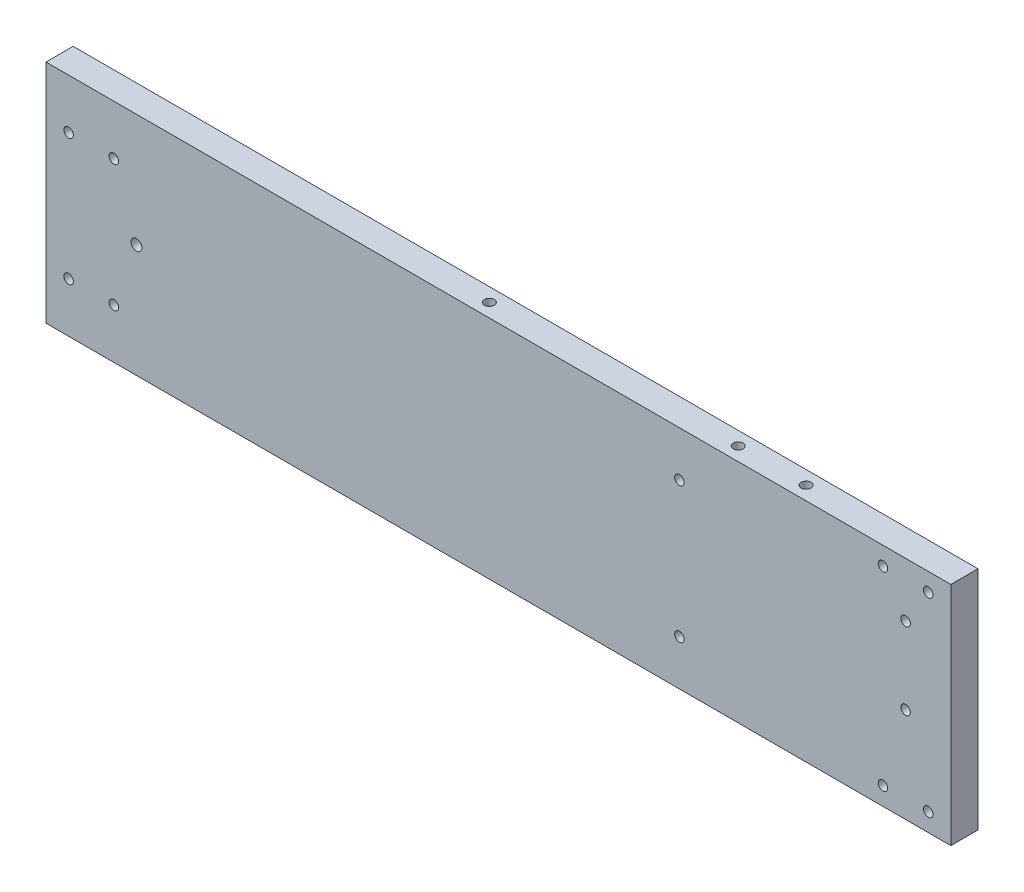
from build123d import *

# Parameters (mm, degrees)
ESQUISSE1_W             = 200
ESQUISSE1_H             = 50
EXTRUSION1_DEPTH        = 6
ESQUISSE2_R             = 1.05
ENL_V_MAT_EXTRU_1_DEPTH = 2
ESQUISSE3_R             = 1.05
ENL_V_MAT_EXTRU_2_DEPTH = 2
ESQUISSE4_R             = 1.05
ENL_V_MAT_EXTRU_3_DEPTH = 2
ESQUISSE5_R             = 1.1
ENL_V_MAT_EXTRU_4_DEPTH = 3
ESQUISSE6_R             = 1.1
ENL_V_MAT_EXTRU_5_DEPTH = 3
ESQUISSE7_R             = 1.05
ENL_V_MAT_EXTRU_6_DEPTH = 202.645728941
ESQUISSE8_R             = 1.2
ENL_V_MAT_EXTRU_7_DEPTH = 2


with BuildPart() as part:
    # Esquisse1 → Extrusion1 (new body)
    with BuildSketch(Plane.XY):
        with Locations((-100, 0)):
            Rectangle(ESQUISSE1_W, ESQUISSE1_H)
    extrude(amount=-EXTRUSION1_DEPTH)

    # Esquisse2 → Enl_v. mat.-Extru.1 (cut)
    with BuildSketch(Plane.XY):
        with Locations((-5, 21)):
            Circle(ESQUISSE2_R)
        with Locations((-15, 21)):
            Circle(ESQUISSE2_R)
        with Locations(Location((-5, -21, 0), (0, 0, 180))):
            Circle(ESQUISSE2_R)
        with Locations(Location((-15, -21, 0), (0, 0, 180))):
            Circle(ESQUISSE2_R)
    extrude(amount=-ENL_V_MAT_EXTRU_1_DEPTH, mode=Mode.SUBTRACT)

    # Esquisse3 → Enl_v. mat.-Extru.2 (cut)
    with BuildSketch(Plane.XY):
        with Locations((-60, 15)):
            Circle(ESQUISSE3_R)
        with Locations((-60, -15)):
            Circle(ESQUISSE3_R)
    extrude(amount=-ENL_V_MAT_EXTRU_2_DEPTH, mode=Mode.SUBTRACT)

    # Esquisse4 → Enl_v. mat.-Extru.3 (cut)
    with BuildSketch(Plane.XY):
        with Locations((-10, 13)):
            Circle(ESQUISSE4_R)
        with Locations((-10, -4)):
            Circle(ESQUISSE4_R)
    extrude(amount=-ENL_V_MAT_EXTRU_3_DEPTH, mode=Mode.SUBTRACT)

    # Esquisse5 → Enl_v. mat.-Extru.4 (cut)
    with BuildSketch(Plane.XZ.offset(25)):
        with Locations(Location((-30, -3.255134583, 0), (0, 0, 270))):
            Circle(ESQUISSE5_R)
        with Locations(Location((-105, -3.255134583, 0), (0, 0, 270))):
            Circle(ESQUISSE5_R)
        with Locations(Location((-50, -3.255134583, 0), (0, 0, 270))):
            Circle(ESQUISSE5_R)
    extrude(amount=-ENL_V_MAT_EXTRU_4_DEPTH, mode=Mode.SUBTRACT)

    # Esquisse6 → Enl_v. mat.-Extru.5 (cut)
    with BuildSketch(Plane(origin=(0, 25, 0), x_dir=(-1, 0, 0), z_dir=(0, 1, 0))):
        with Locations(Location((35, -3, 0), (0, 0, 90))):
            Circle(ESQUISSE6_R)
        with Locations(Location((105, -3, 0), (0, 0, 90))):
            Circle(ESQUISSE6_R)
        with Locations(Location((50, -3, 0), (0, 0, 90))):
            Circle(ESQUISSE6_R)
    extrude(amount=-ENL_V_MAT_EXTRU_5_DEPTH, mode=Mode.SUBTRACT)

    # Esquisse7 → Enl_v. mat.-Extru.6 (cut, through all)
    with BuildSketch(Plane.XY):
        with Locations((-195, 14)):
            Circle(ESQUISSE7_R)
        with Locations((-185, 14)):
            Circle(ESQUISSE7_R)
        with Locations(Location((-185, -14, 0), (0, 0, 180))):
            Circle(ESQUISSE7_R)
        with Locations(Location((-195, -14, 0), (0, 0, 180))):
            Circle(ESQUISSE7_R)
    extrude(amount=-ENL_V_MAT_EXTRU_6_DEPTH, mode=Mode.SUBTRACT)

    # Esquisse8 → Enl_v. mat.-Extru.7 (cut)
    with BuildSketch(Plane.XY):
        with Locations((-180, 0)):
            Circle(ESQUISSE8_R)
    extrude(amount=-ENL_V_MAT_EXTRU_7_DEPTH, mode=Mode.SUBTRACT)


solid = part.part
